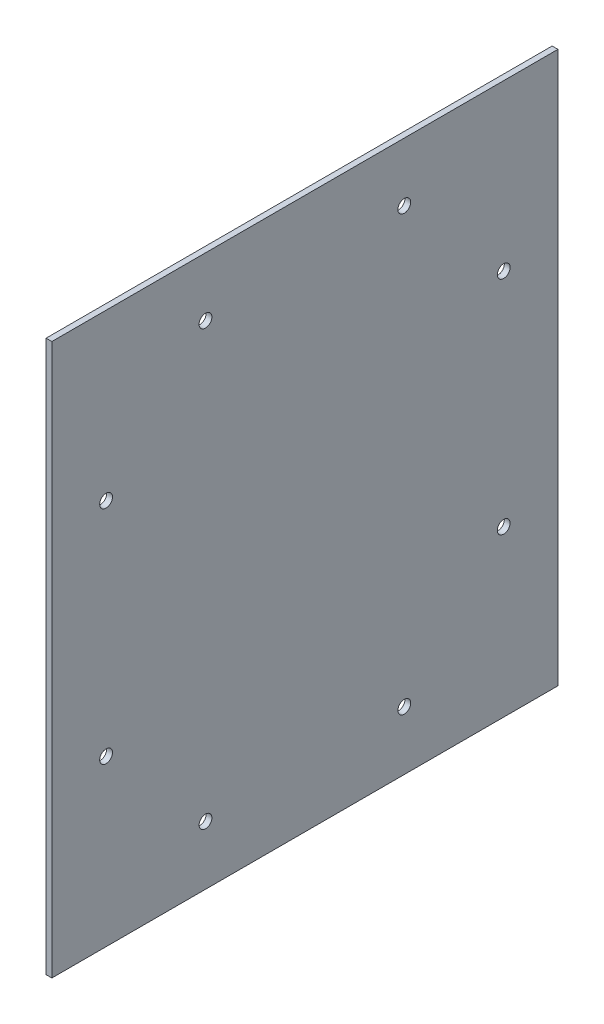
from build123d import *

# Parameters (mm, degrees)
SKETCH1_W            = 355.6
SKETCH1_H            = 387.35
SKETCH1_R            = 4.0005
BOSS_EXTRUDE1_DEPTH  = 4.064
M8_CLEARANCE_HOLE1_D = 9


with BuildPart() as part:
    # Sketch1 → Boss-Extrude1 (new body)
    # profile 1 of 9: a face of its own
    with BuildSketch(Plane(origin=(0, 0, 0), x_dir=(0, 0, -1), z_dir=(1, 0, 0))):
        Rectangle(SKETCH1_W, SKETCH1_H)
        with Locations((139.7, 77.7875)):
            Circle(SKETCH1_R, mode=Mode.SUBTRACT)
        with Locations((69.85, 152.4)):
            Circle(SKETCH1_R, mode=Mode.SUBTRACT)
        with Locations((-139.7, 77.7875)):
            Circle(SKETCH1_R, mode=Mode.SUBTRACT)
        with Locations((-139.7, -77.7875)):
            Circle(SKETCH1_R, mode=Mode.SUBTRACT)
        with Locations((-69.85, -152.4)):
            Circle(SKETCH1_R, mode=Mode.SUBTRACT)
        with Locations((69.85, -152.4)):
            Circle(SKETCH1_R, mode=Mode.SUBTRACT)
        with Locations((-69.85, 152.4)):
            Circle(SKETCH1_R, mode=Mode.SUBTRACT)
        with Locations((139.7, -77.7875)):
            Circle(SKETCH1_R, mode=Mode.SUBTRACT)
    # profile 2 of 9: a face of its own
    with BuildSketch(Plane(origin=(0, 0, 0), x_dir=(0, 0, -1), z_dir=(1, 0, 0))):
        with Locations((-69.85, -152.4)):
            Circle(SKETCH1_R)
    # profile 3 of 9: a face of its own
    with BuildSketch(Plane(origin=(0, 0, 0), x_dir=(0, 0, -1), z_dir=(1, 0, 0))):
        with Locations((69.85, -152.4)):
            Circle(SKETCH1_R)
    # profile 4 of 9: a face of its own
    with BuildSketch(Plane(origin=(0, 0, 0), x_dir=(0, 0, -1), z_dir=(1, 0, 0))):
        with Locations((139.7, -77.7875)):
            Circle(SKETCH1_R)
    # profile 5 of 9: a face of its own
    with BuildSketch(Plane(origin=(0, 0, 0), x_dir=(0, 0, -1), z_dir=(1, 0, 0))):
        with Locations((139.7, 77.7875)):
            Circle(SKETCH1_R)
    # profile 6 of 9: a face of its own
    with BuildSketch(Plane(origin=(0, 0, 0), x_dir=(0, 0, -1), z_dir=(1, 0, 0))):
        with Locations((69.85, 152.4)):
            Circle(SKETCH1_R)
    # profile 7 of 9: a face of its own
    with BuildSketch(Plane(origin=(0, 0, 0), x_dir=(0, 0, -1), z_dir=(1, 0, 0))):
        with Locations((-69.85, 152.4)):
            Circle(SKETCH1_R)
    # profile 8 of 9: a face of its own
    with BuildSketch(Plane(origin=(0, 0, 0), x_dir=(0, 0, -1), z_dir=(1, 0, 0))):
        with Locations((-139.7, 77.7875)):
            Circle(SKETCH1_R)
    # profile 9 of 9: a face of its own
    with BuildSketch(Plane(origin=(0, 0, 0), x_dir=(0, 0, -1), z_dir=(1, 0, 0))):
        with Locations((-139.7, -77.7875)):
            Circle(SKETCH1_R)
    extrude(amount=BOSS_EXTRUDE1_DEPTH)

    # M8 Clearance Hole1 (through all)
    with Locations(Plane(origin=(4.064, 0, 0), x_dir=(0, 0, -1), z_dir=(1, 0, 0))):
        with Locations((-139.7, 77.7875), (-69.85, 152.4), (69.85, 152.4), (139.7, 77.7875), (139.7, -77.7875), (69.85, -152.4), (-69.85, -152.4), (-139.7, -77.7875)):
            Hole(M8_CLEARANCE_HOLE1_D / 2)


solid = part.part
